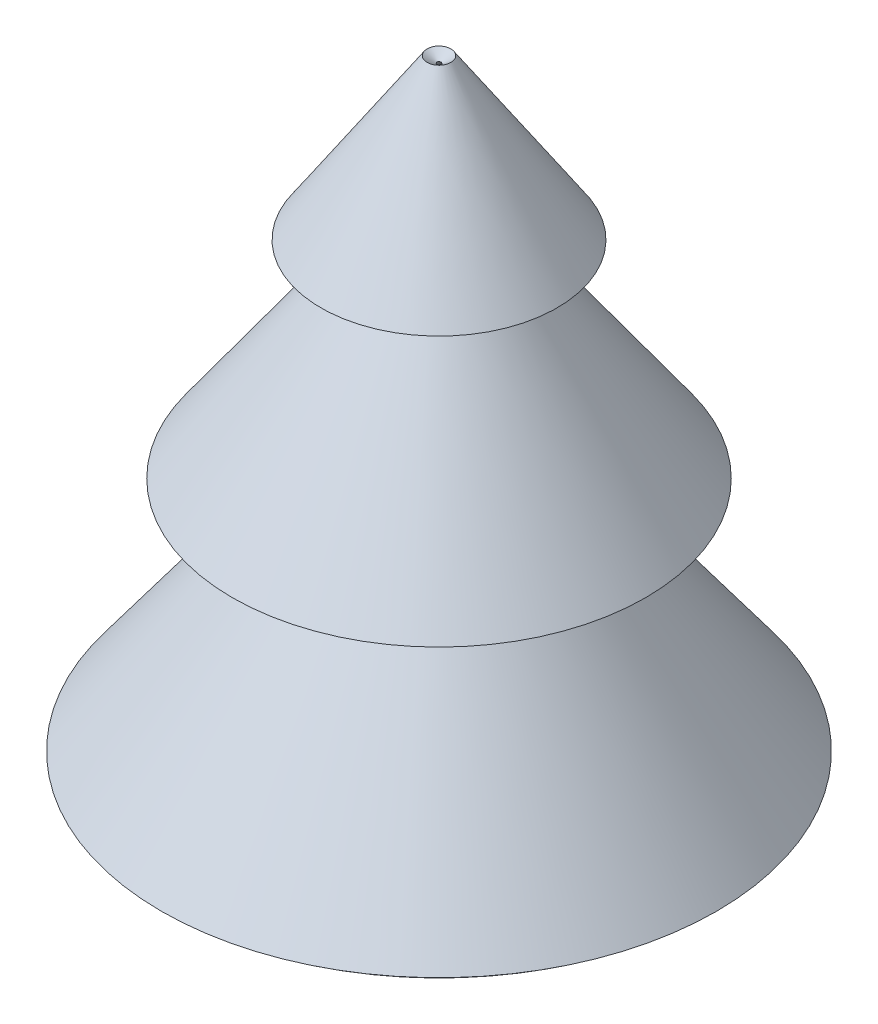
from build123d import *


with BuildPart() as part:
    # Sketch 1 → Revolve 18 (revolve)
    with BuildSketch(Plane.XY, mode=Mode.PRIVATE) as revolve_18_sk:
        Polygon((-47, 0), (-17.5, 40), (-35, 40), (-10, 75), (-20, 75), (-2, 102), (-0.335899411, 100.890599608), (-16.262965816, 77), (-6.113621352, 77), (-31.113621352, 42), (-13.539919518, 42), (-45.390394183, -1.18708429), align=None)
    revolve(revolve_18_sk.sketch.rotate(Axis((0, 0, 0), (0, 1, 0)), 270), axis=Axis((0, 0, 0), (0, 1, 0)))


solid = part.part
